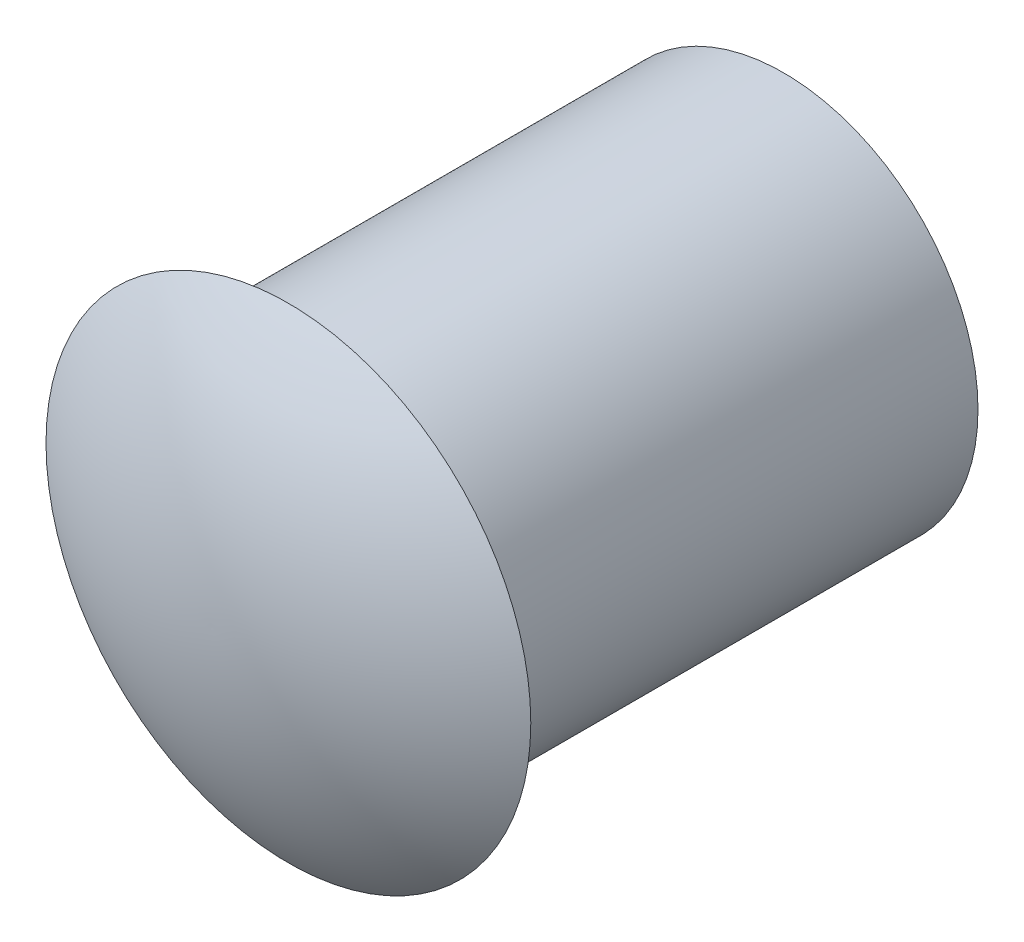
from build123d import *

# Parameters (mm, degrees)
SKETCH1_R           = 2.992510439
BOSS_EXTRUDE1_DEPTH = 7.62


with BuildPart() as part:
    # Sketch1 → Boss-Extrude1 (new body)
    with BuildSketch(Plane.XY):
        Circle(SKETCH1_R)
    extrude(amount=-BOSS_EXTRUDE1_DEPTH)

    # Sketch2 → Revolve1 (revolve)
    with BuildSketch(Plane(origin=(0, 0, 0), x_dir=(1, 0, 0), z_dir=(0, 1, 0))):
        with BuildLine():
            Line((-3.730319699, 0), (0, 0))
            Line((0, 0), (0, -1.180813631))
            ThreePointArc((0, -1.180813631), (-1.958531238, -0.885377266), (-3.730319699, 0))
        make_face()
    revolve(axis=Axis((0, 0, 0), (0, 0, 1)))


solid = part.part
